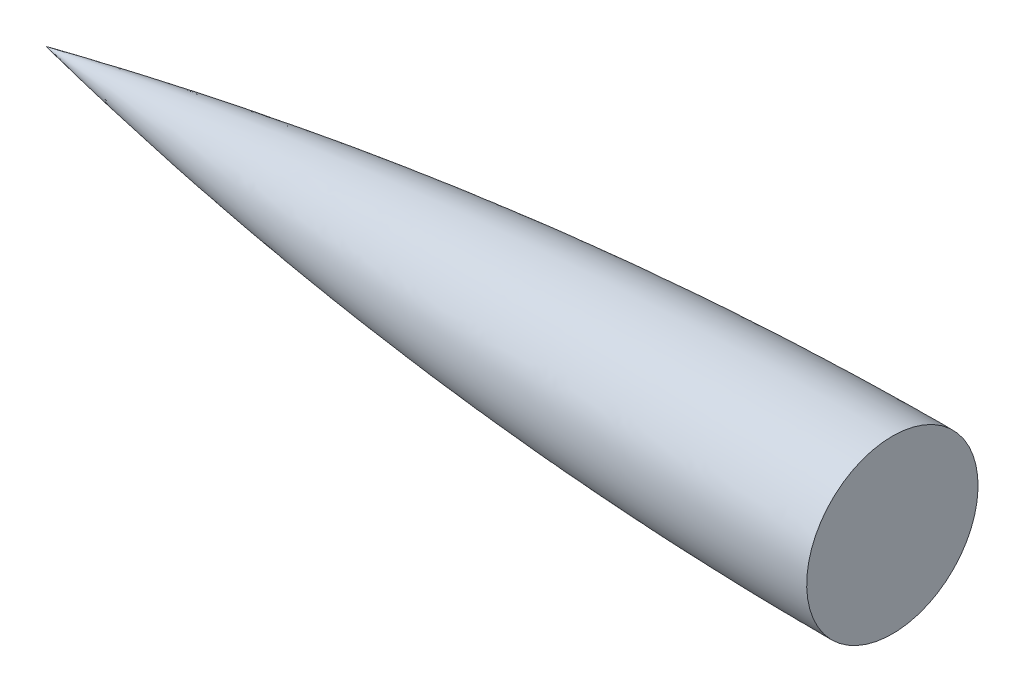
from build123d import *


with BuildPart() as part:
    # Sketch1 → Revolve1 (revolve)
    with BuildSketch(Plane.XY):
        with BuildLine():
            Line((0, 0), (0, 6.858))
            ThreePointArc((0, 6.858), (-34.04402896, 5.139129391), (-67.7418, 0))
            Line((-67.7418, 0), (0, 0))
        make_face()
    revolve(axis=Axis((0, 0, 0), (-1, 0, 0)))


solid = part.part
